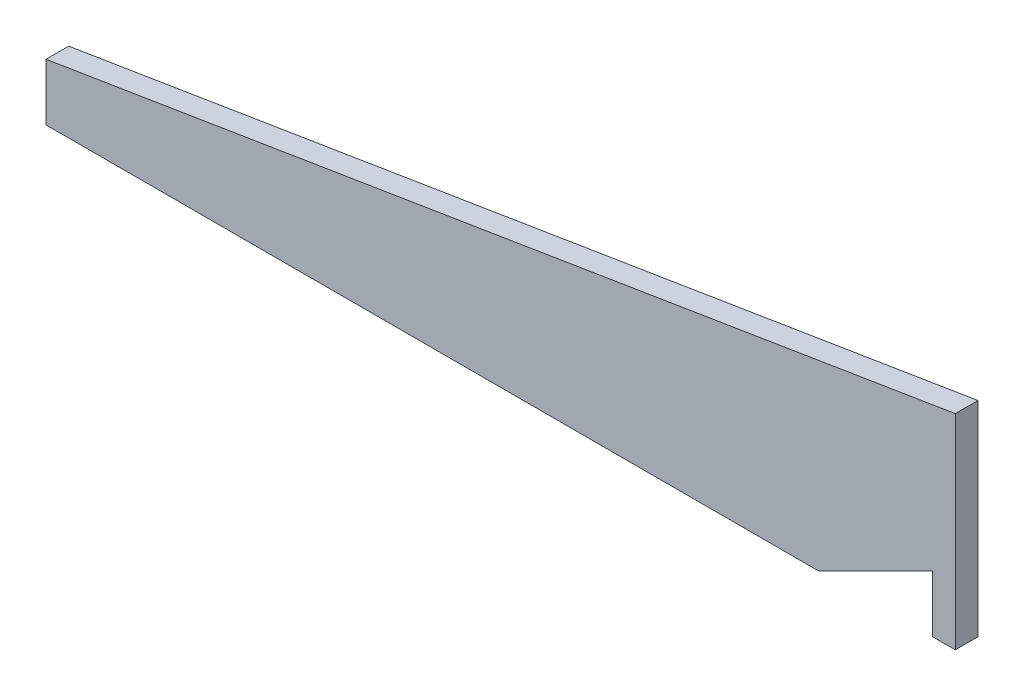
from build123d import *

# Parameters (mm, degrees)
BOSS_EXTRUDE1_DEPTH = 2


with BuildPart() as part:
    # Sketch1 → Boss-Extrude1 (new body)
    with BuildSketch(Plane.XY):
        Polygon((-31.510516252, 5), (-31.510516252, 0), (36.489483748, 0), (46.489483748, 5), (46.489483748, 0), (48.489483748, 0), (48.489483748, 18), align=None)
    extrude(amount=BOSS_EXTRUDE1_DEPTH)


solid = part.part
